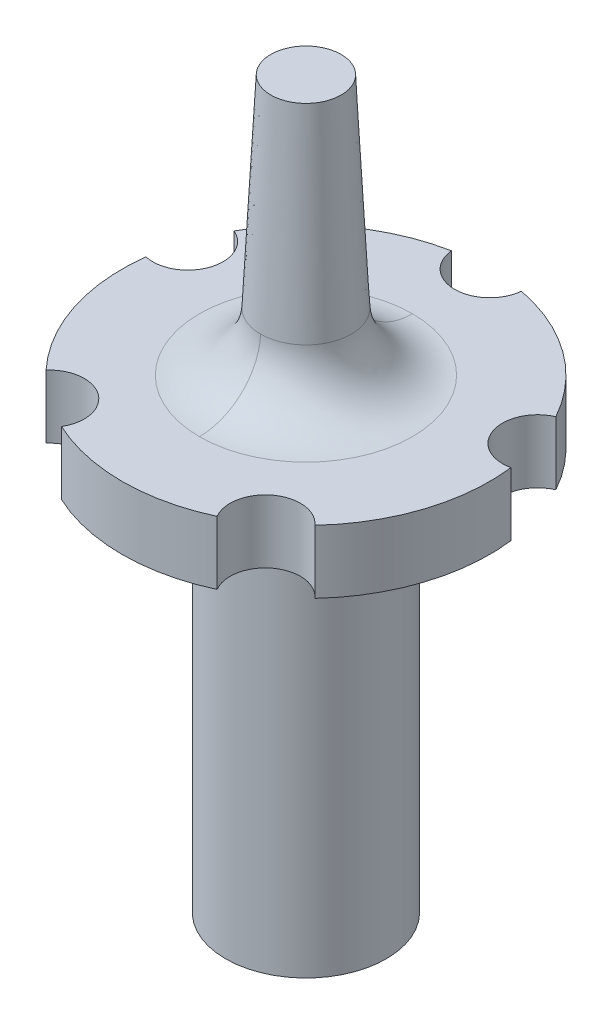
ISO-10303-21;
HEADER;
FILE_DESCRIPTION(('STEP AP214'),'2;1');
FILE_NAME('part.step','',(''),(''),'','','');
FILE_SCHEMA(('AUTOMOTIVE_DESIGN { 1 0 10303 214 1 1 1 1 }'));
ENDSEC;
DATA;
#1=APPLICATION_CONTEXT('core data for automotive mechanical design processes');
#2=APPLICATION_PROTOCOL_DEFINITION('international standard','automotive_design',2000,#1);
#3=PRODUCT_CONTEXT('',#1,'mechanical');
#4=PRODUCT('Part','Part','',(#3));
#5=PRODUCT_RELATED_PRODUCT_CATEGORY('part','',(#4));
#6=PRODUCT_DEFINITION_FORMATION('','',#4);
#7=PRODUCT_DEFINITION_CONTEXT('part definition',#1,'design');
#8=PRODUCT_DEFINITION('design','',#6,#7);
#9=PRODUCT_DEFINITION_SHAPE('','',#8);
#10=(LENGTH_UNIT() NAMED_UNIT(*) SI_UNIT(.MILLI.,.METRE.));
#11=(NAMED_UNIT(*) PLANE_ANGLE_UNIT() SI_UNIT($,.RADIAN.));
#12=(NAMED_UNIT(*) SI_UNIT($,.STERADIAN.) SOLID_ANGLE_UNIT());
#13=UNCERTAINTY_MEASURE_WITH_UNIT(LENGTH_MEASURE(1.E-05),#10,'distance_accuracy_value','');
#14=(GEOMETRIC_REPRESENTATION_CONTEXT(3) GLOBAL_UNCERTAINTY_ASSIGNED_CONTEXT((#13)) GLOBAL_UNIT_ASSIGNED_CONTEXT((#10,
#11,#12)) REPRESENTATION_CONTEXT('',''));
#15=CARTESIAN_POINT('',(0.,0.,0.));
#16=DIRECTION('',(0.,0.,1.));
#17=DIRECTION('',(1.,0.,0.));
#18=AXIS2_PLACEMENT_3D('',#15,#16,#17);
#19=CARTESIAN_POINT('',(0.,8.1788,0.));
#20=DIRECTION('',(0.,1.,0.));
#21=DIRECTION('',(0.,0.,1.));
#22=AXIS2_PLACEMENT_3D('',#19,#20,#21);
#23=PLANE('',#22);
#24=CARTESIAN_POINT('',(0.,8.17879999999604,0.));
#25=DIRECTION('',(0.,-1.,0.));
#26=DIRECTION('',(1.,0.,0.));
#27=AXIS2_PLACEMENT_3D('',#24,#25,#26);
#28=CIRCLE('',#27,0.889000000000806);
#29=CARTESIAN_POINT('',(0.889000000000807,8.17879999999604,0.));
#30=VERTEX_POINT('',#29);
#31=EDGE_CURVE('E20',#30,#30,#28,.T.);
#32=ORIENTED_EDGE('',*,*,#31,.F.);
#33=EDGE_LOOP('',(#32));
#34=FACE_BOUND('',#33,.T.);
#35=ADVANCED_FACE('F17',(#34),#23,.T.);
#36=CARTESIAN_POINT('',(0.,3.07192865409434,0.));
#37=DIRECTION('',(0.,-1.,0.));
#38=DIRECTION('',(1.,0.,0.));
#39=AXIS2_PLACEMENT_3D('',#36,#37,#38);
#40=CONICAL_SURFACE('',#39,1.14532945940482,0.0501509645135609);
#41=CARTESIAN_POINT('',(-1.27000007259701E-08,3.07192865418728,0.));
#42=DIRECTION('',(0.,1.,0.));
#43=DIRECTION('',(7.815365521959E-09,0.,1.));
#44=AXIS2_PLACEMENT_3D('',#41,#42,#43);
#45=CIRCLE('',#44,1.14532946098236);
#46=CARTESIAN_POINT('',(-2.10932666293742E-09,3.07192865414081,1.14532946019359));
#47=VERTEX_POINT('',#46);
#48=CARTESIAN_POINT('',(0.,3.0719286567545,-1.14532946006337));
#49=VERTEX_POINT('',#48);
#50=EDGE_CURVE('E54',#47,#49,#45,.T.);
#51=ORIENTED_EDGE('',*,*,#50,.T.);
#52=CARTESIAN_POINT('',(1.27000007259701E-08,3.07192865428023,0.));
#53=DIRECTION('',(0.,1.,0.));
#54=DIRECTION('',(-7.815365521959E-09,0.,-1.));
#55=AXIS2_PLACEMENT_3D('',#52,#53,#54);
#56=CIRCLE('',#55,1.14532946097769);
#57=EDGE_CURVE('E69',#49,#47,#56,.T.);
#58=ORIENTED_EDGE('',*,*,#57,.T.);
#59=EDGE_LOOP('',(#51,#58));
#60=FACE_BOUND('',#59,.T.);
#61=ORIENTED_EDGE('',*,*,#31,.T.);
#62=EDGE_LOOP('',(#61));
#63=FACE_BOUND('',#62,.T.);
#64=ADVANCED_FACE('F70',(#60,#63),#40,.T.);
#65=CARTESIAN_POINT('',(-1.27000007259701E-08,3.14959999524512,0.));
#66=DIRECTION('',(0.,1.,0.));
#67=DIRECTION('',(7.815365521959E-09,0.,1.));
#68=AXIS2_PLACEMENT_3D('',#65,#66,#67);
#69=TOROIDAL_SURFACE('',#68,2.69278140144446,1.54939999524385);
#70=ORIENTED_EDGE('',*,*,#50,.F.);
#71=CARTESIAN_POINT('',(-1.8263537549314E-08,3.14959999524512,2.69278140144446));
#72=DIRECTION('',(1.,0.,1.14987195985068E-08));
#73=DIRECTION('',(-1.14987195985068E-08,0.,1.));
#74=AXIS2_PLACEMENT_3D('',#71,#72,#73);
#75=CIRCLE('',#74,1.54939999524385);
#76=CARTESIAN_POINT('',(-3.30615578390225E-09,1.60020000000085,2.69278140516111));
#77=VERTEX_POINT('',#76);
#78=EDGE_CURVE('E63',#47,#77,#75,.F.);
#79=ORIENTED_EDGE('',*,*,#78,.T.);
#80=CARTESIAN_POINT('',(-1.27000007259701E-08,1.60020000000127,0.));
#81=DIRECTION('',(0.,1.,0.));
#82=DIRECTION('',(7.815365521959E-09,0.,1.));
#83=AXIS2_PLACEMENT_3D('',#80,#81,#82);
#84=CIRCLE('',#83,2.69278140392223);
#85=CARTESIAN_POINT('',(8.65760356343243E-09,1.60020000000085,-2.69278140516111));
#86=VERTEX_POINT('',#85);
#87=EDGE_CURVE('E73',#86,#77,#84,.F.);
#88=ORIENTED_EDGE('',*,*,#87,.F.);
#89=CARTESIAN_POINT('',(1.71589410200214E-08,3.14959999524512,-2.69278140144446));
#90=DIRECTION('',(-1.,0.,-1.10885130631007E-08));
#91=DIRECTION('',(1.10885130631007E-08,0.,-1.));
#92=AXIS2_PLACEMENT_3D('',#89,#90,#91);
#93=CIRCLE('',#92,1.54939999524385);
#94=EDGE_CURVE('E66',#86,#49,#93,.T.);
#95=ORIENTED_EDGE('',*,*,#94,.T.);
#96=EDGE_LOOP('',(#70,#79,#88,#95));
#97=FACE_BOUND('',#96,.T.);
#98=ADVANCED_FACE('F61',(#97),#69,.F.);
#99=CARTESIAN_POINT('',(1.27000007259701E-08,3.14959999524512,0.));
#100=DIRECTION('',(0.,1.,0.));
#101=DIRECTION('',(-7.815365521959E-09,0.,-1.));
#102=AXIS2_PLACEMENT_3D('',#99,#100,#101);
#103=TOROIDAL_SURFACE('',#102,2.69278140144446,1.54939999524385);
#104=ORIENTED_EDGE('',*,*,#94,.F.);
#105=CARTESIAN_POINT('',(1.27000007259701E-08,1.60020000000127,0.));
#106=DIRECTION('',(0.,1.,0.));
#107=DIRECTION('',(-7.815365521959E-09,0.,-1.));
#108=AXIS2_PLACEMENT_3D('',#105,#106,#107);
#109=CIRCLE('',#108,2.69278140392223);
#110=EDGE_CURVE('E77',#77,#86,#109,.F.);
#111=ORIENTED_EDGE('',*,*,#110,.F.);
#112=ORIENTED_EDGE('',*,*,#78,.F.);
#113=ORIENTED_EDGE('',*,*,#57,.F.);
#114=EDGE_LOOP('',(#104,#111,#112,#113));
#115=FACE_BOUND('',#114,.T.);
#116=ADVANCED_FACE('F75',(#115),#103,.F.);
#117=CARTESIAN_POINT('',(1.39980431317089E-06,1.6002,0.0425068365));
#118=DIRECTION('',(0.,1.,0.));
#119=DIRECTION('',(0.,0.,1.));
#120=AXIS2_PLACEMENT_3D('',#117,#118,#119);
#121=PLANE('',#120);
#122=ORIENTED_EDGE('',*,*,#87,.T.);
#123=ORIENTED_EDGE('',*,*,#110,.T.);
#124=EDGE_LOOP('',(#122,#123));
#125=FACE_BOUND('',#124,.T.);
#126=CARTESIAN_POINT('',(0.,1.6002,0.));
#127=DIRECTION('',(0.,1.,0.));
#128=DIRECTION('',(0.,0.,1.));
#129=AXIS2_PLACEMENT_3D('',#126,#127,#128);
#130=CIRCLE('',#129,4.6482);
#131=CARTESIAN_POINT('',(0.884925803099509,1.6002,-4.56318633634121));
#132=VERTEX_POINT('',#131);
#133=CARTESIAN_POINT('',(4.06639099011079,1.6002,-2.2517165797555));
#134=VERTEX_POINT('',#133);
#135=EDGE_CURVE('E105',#132,#134,#130,.F.);
#136=ORIENTED_EDGE('',*,*,#135,.F.);
#137=CARTESIAN_POINT('',(0.,1.6002,-4.6482));
#138=DIRECTION('',(0.,1.,0.));
#139=DIRECTION('',(0.,0.,1.));
#140=AXIS2_PLACEMENT_3D('',#137,#138,#139);
#141=CIRCLE('',#140,0.889);
#142=CARTESIAN_POINT('',(-0.884925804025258,1.6002,-4.56318633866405));
#143=VERTEX_POINT('',#142);
#144=EDGE_CURVE('E109',#132,#143,#141,.F.);
#145=ORIENTED_EDGE('',*,*,#144,.T.);
#146=CARTESIAN_POINT('',(0.,1.6002,0.));
#147=DIRECTION('',(0.,1.,0.));
#148=DIRECTION('',(0.,0.,1.));
#149=AXIS2_PLACEMENT_3D('',#146,#147,#148);
#150=CIRCLE('',#149,4.6482);
#151=CARTESIAN_POINT('',(-4.06639098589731,1.6002,-2.25171658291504));
#152=VERTEX_POINT('',#151);
#153=EDGE_CURVE('E112',#152,#143,#150,.F.);
#154=ORIENTED_EDGE('',*,*,#153,.F.);
#155=CARTESIAN_POINT('',(-4.4207008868,1.6002,-1.436372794));
#156=DIRECTION('',(0.,1.,0.));
#157=DIRECTION('',(0.,0.,1.));
#158=AXIS2_PLACEMENT_3D('',#155,#156,#157);
#159=CIRCLE('',#158,0.889);
#160=CARTESIAN_POINT('',(-4.613305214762,1.6002,-0.568487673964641));
#161=VERTEX_POINT('',#160);
#162=EDGE_CURVE('E116',#152,#161,#159,.F.);
#163=ORIENTED_EDGE('',*,*,#162,.T.);
#164=CARTESIAN_POINT('',(0.,1.6002,0.));
#165=DIRECTION('',(0.,1.,0.));
#166=DIRECTION('',(0.,0.,1.));
#167=AXIS2_PLACEMENT_3D('',#164,#165,#166);
#168=CIRCLE('',#167,4.6482);
#169=CARTESIAN_POINT('',(-3.39809364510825,1.6002,3.17154896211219));
#170=VERTEX_POINT('',#169);
#171=EDGE_CURVE('E121',#170,#161,#168,.F.);
#172=ORIENTED_EDGE('',*,*,#171,.F.);
#173=CARTESIAN_POINT('',(-2.7321434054,1.6002,3.760472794));
#174=DIRECTION('',(0.,1.,0.));
#175=DIRECTION('',(0.,0.,1.));
#176=AXIS2_PLACEMENT_3D('',#173,#174,#175);
#177=CIRCLE('',#176,0.889);
#178=CARTESIAN_POINT('',(-1.9662536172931,1.6002,4.21184163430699));
#179=VERTEX_POINT('',#178);
#180=EDGE_CURVE('E86',#170,#179,#177,.F.);
#181=ORIENTED_EDGE('',*,*,#180,.T.);
#182=CARTESIAN_POINT('',(0.,1.6002,0.));
#183=DIRECTION('',(0.,1.,0.));
#184=DIRECTION('',(0.,0.,1.));
#185=AXIS2_PLACEMENT_3D('',#182,#183,#184);
#186=CIRCLE('',#185,4.6482);
#187=CARTESIAN_POINT('',(1.96625361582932,1.6002,4.21184163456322));
#188=VERTEX_POINT('',#187);
#189=EDGE_CURVE('E90',#188,#179,#186,.F.);
#190=ORIENTED_EDGE('',*,*,#189,.F.);
#191=CARTESIAN_POINT('',(2.7321434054,1.6002,3.760472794));
#192=DIRECTION('',(0.,1.,0.));
#193=DIRECTION('',(0.,0.,1.));
#194=AXIS2_PLACEMENT_3D('',#191,#192,#193);
#195=CIRCLE('',#194,0.889);
#196=CARTESIAN_POINT('',(3.39809364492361,1.6002,3.17154896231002));
#197=VERTEX_POINT('',#196);
#198=EDGE_CURVE('E93',#188,#197,#195,.F.);
#199=ORIENTED_EDGE('',*,*,#198,.T.);
#200=CARTESIAN_POINT('',(0.,1.6002,0.));
#201=DIRECTION('',(0.,1.,0.));
#202=DIRECTION('',(0.,0.,1.));
#203=AXIS2_PLACEMENT_3D('',#200,#201,#202);
#204=CIRCLE('',#203,4.6482);
#205=CARTESIAN_POINT('',(4.61330521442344,1.6002,-0.568487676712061));
#206=VERTEX_POINT('',#205);
#207=EDGE_CURVE('E97',#206,#197,#204,.F.);
#208=ORIENTED_EDGE('',*,*,#207,.F.);
#209=CARTESIAN_POINT('',(4.4207008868,1.6002,-1.436372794));
#210=DIRECTION('',(0.,1.,0.));
#211=DIRECTION('',(0.,0.,1.));
#212=AXIS2_PLACEMENT_3D('',#209,#210,#211);
#213=CIRCLE('',#212,0.889);
#214=EDGE_CURVE('E100',#206,#134,#213,.F.);
#215=ORIENTED_EDGE('',*,*,#214,.T.);
#216=EDGE_LOOP('',(#136,#145,#154,#163,#172,#181,#190,#199,#208,#215));
#217=FACE_BOUND('',#216,.T.);
#218=ADVANCED_FACE('F185',(#125,#217),#121,.T.);
#219=CARTESIAN_POINT('',(-2.7321434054,0.,3.760472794));
#220=DIRECTION('',(0.,1.,0.));
#221=DIRECTION('',(0.,0.,1.));
#222=AXIS2_PLACEMENT_3D('',#219,#220,#221);
#223=CYLINDRICAL_SURFACE('',#222,0.889);
#224=CARTESIAN_POINT('',(-2.7321434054,0.,3.760472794));
#225=DIRECTION('',(0.,1.,0.));
#226=DIRECTION('',(0.,0.,1.));
#227=AXIS2_PLACEMENT_3D('',#224,#225,#226);
#228=CIRCLE('',#227,0.889);
#229=CARTESIAN_POINT('',(-3.39809364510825,0.,3.17154896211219));
#230=VERTEX_POINT('',#229);
#231=CARTESIAN_POINT('',(-1.9662536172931,0.,4.21184163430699));
#232=VERTEX_POINT('',#231);
#233=EDGE_CURVE('E124',#230,#232,#228,.F.);
#234=ORIENTED_EDGE('',*,*,#233,.T.);
#235=DIRECTION('',(0.,1.,0.));
#236=VECTOR('',#235,1.);
#237=CARTESIAN_POINT('',(-1.96625361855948,0.,4.2118416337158));
#238=LINE('',#237,#236);
#239=EDGE_CURVE('E89',#179,#232,#238,.F.);
#240=ORIENTED_EDGE('',*,*,#239,.F.);
#241=ORIENTED_EDGE('',*,*,#180,.F.);
#242=DIRECTION('',(0.,1.,0.));
#243=VECTOR('',#242,1.);
#244=CARTESIAN_POINT('',(-3.39809364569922,0.,3.17154896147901));
#245=LINE('',#244,#243);
#246=EDGE_CURVE('E125',#230,#170,#245,.T.);
#247=ORIENTED_EDGE('',*,*,#246,.F.);
#248=EDGE_LOOP('',(#234,#240,#241,#247));
#249=FACE_BOUND('',#248,.T.);
#250=ADVANCED_FACE('F194',(#249),#223,.F.);
#251=CARTESIAN_POINT('',(0.,0.,0.));
#252=DIRECTION('',(0.,1.,0.));
#253=DIRECTION('',(0.,0.,1.));
#254=AXIS2_PLACEMENT_3D('',#251,#252,#253);
#255=CYLINDRICAL_SURFACE('',#254,4.6482);
#256=ORIENTED_EDGE('',*,*,#189,.T.);
#257=ORIENTED_EDGE('',*,*,#239,.T.);
#258=CARTESIAN_POINT('',(0.,0.,0.));
#259=DIRECTION('',(0.,1.,0.));
#260=DIRECTION('',(0.,0.,1.));
#261=AXIS2_PLACEMENT_3D('',#258,#259,#260);
#262=CIRCLE('',#261,4.6482);
#263=CARTESIAN_POINT('',(1.96625361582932,0.,4.21184163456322));
#264=VERTEX_POINT('',#263);
#265=EDGE_CURVE('E128',#232,#264,#262,.T.);
#266=ORIENTED_EDGE('',*,*,#265,.T.);
#267=DIRECTION('',(0.,1.,0.));
#268=VECTOR('',#267,1.);
#269=CARTESIAN_POINT('',(1.96625361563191,0.,4.21184163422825));
#270=LINE('',#269,#268);
#271=EDGE_CURVE('E96',#264,#188,#270,.T.);
#272=ORIENTED_EDGE('',*,*,#271,.T.);
#273=EDGE_LOOP('',(#256,#257,#266,#272));
#274=FACE_BOUND('',#273,.T.);
#275=ADVANCED_FACE('F249',(#274),#255,.T.);
#276=CARTESIAN_POINT('',(2.7321434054,0.,3.760472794));
#277=DIRECTION('',(0.,1.,0.));
#278=DIRECTION('',(0.,0.,1.));
#279=AXIS2_PLACEMENT_3D('',#276,#277,#278);
#280=CYLINDRICAL_SURFACE('',#279,0.889);
#281=CARTESIAN_POINT('',(2.7321434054,0.,3.760472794));
#282=DIRECTION('',(0.,1.,0.));
#283=DIRECTION('',(0.,0.,1.));
#284=AXIS2_PLACEMENT_3D('',#281,#282,#283);
#285=CIRCLE('',#284,0.889);
#286=CARTESIAN_POINT('',(3.39809364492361,0.,3.17154896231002));
#287=VERTEX_POINT('',#286);
#288=EDGE_CURVE('E131',#264,#287,#285,.F.);
#289=ORIENTED_EDGE('',*,*,#288,.T.);
#290=DIRECTION('',(0.,1.,0.));
#291=VECTOR('',#290,1.);
#292=CARTESIAN_POINT('',(3.39809364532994,0.,3.17154896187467));
#293=LINE('',#292,#291);
#294=EDGE_CURVE('E211',#197,#287,#293,.F.);
#295=ORIENTED_EDGE('',*,*,#294,.F.);
#296=ORIENTED_EDGE('',*,*,#198,.F.);
#297=ORIENTED_EDGE('',*,*,#271,.F.);
#298=EDGE_LOOP('',(#289,#295,#296,#297));
#299=FACE_BOUND('',#298,.T.);
#300=ADVANCED_FACE('F300',(#299),#280,.F.);
#301=CARTESIAN_POINT('',(0.,0.,0.));
#302=DIRECTION('',(0.,1.,0.));
#303=DIRECTION('',(0.,0.,1.));
#304=AXIS2_PLACEMENT_3D('',#301,#302,#303);
#305=CYLINDRICAL_SURFACE('',#304,4.6482);
#306=DIRECTION('',(0.,1.,0.));
#307=VECTOR('',#306,1.);
#308=CARTESIAN_POINT('',(4.61330521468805,0.,-0.568487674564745));
#309=LINE('',#308,#307);
#310=CARTESIAN_POINT('',(4.61330521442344,0.,-0.568487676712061));
#311=VERTEX_POINT('',#310);
#312=EDGE_CURVE('E101',#311,#206,#309,.T.);
#313=ORIENTED_EDGE('',*,*,#312,.T.);
#314=ORIENTED_EDGE('',*,*,#207,.T.);
#315=ORIENTED_EDGE('',*,*,#294,.T.);
#316=CARTESIAN_POINT('',(0.,0.,0.));
#317=DIRECTION('',(0.,1.,0.));
#318=DIRECTION('',(0.,0.,1.));
#319=AXIS2_PLACEMENT_3D('',#316,#317,#318);
#320=CIRCLE('',#319,4.6482);
#321=EDGE_CURVE('E134',#287,#311,#320,.T.);
#322=ORIENTED_EDGE('',*,*,#321,.T.);
#323=EDGE_LOOP('',(#313,#314,#315,#322));
#324=FACE_BOUND('',#323,.T.);
#325=ADVANCED_FACE('F298',(#324),#305,.T.);
#326=CARTESIAN_POINT('',(4.4207008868,0.,-1.436372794));
#327=DIRECTION('',(0.,1.,0.));
#328=DIRECTION('',(0.,0.,1.));
#329=AXIS2_PLACEMENT_3D('',#326,#327,#328);
#330=CYLINDRICAL_SURFACE('',#329,0.889);
#331=CARTESIAN_POINT('',(4.4207008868,0.,-1.436372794));
#332=DIRECTION('',(0.,1.,0.));
#333=DIRECTION('',(0.,0.,1.));
#334=AXIS2_PLACEMENT_3D('',#331,#332,#333);
#335=CIRCLE('',#334,0.889);
#336=CARTESIAN_POINT('',(4.06639099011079,0.,-2.2517165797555));
#337=VERTEX_POINT('',#336);
#338=EDGE_CURVE('E137',#311,#337,#335,.F.);
#339=ORIENTED_EDGE('',*,*,#338,.T.);
#340=DIRECTION('',(0.,1.,0.));
#341=VECTOR('',#340,1.);
#342=CARTESIAN_POINT('',(4.06639099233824,0.,-2.25171657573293));
#343=LINE('',#342,#341);
#344=EDGE_CURVE('E104',#134,#337,#343,.F.);
#345=ORIENTED_EDGE('',*,*,#344,.F.);
#346=ORIENTED_EDGE('',*,*,#214,.F.);
#347=ORIENTED_EDGE('',*,*,#312,.F.);
#348=EDGE_LOOP('',(#339,#345,#346,#347));
#349=FACE_BOUND('',#348,.T.);
#350=ADVANCED_FACE('F296',(#349),#330,.F.);
#351=CARTESIAN_POINT('',(0.,0.,0.));
#352=DIRECTION('',(0.,1.,0.));
#353=DIRECTION('',(0.,0.,1.));
#354=AXIS2_PLACEMENT_3D('',#351,#352,#353);
#355=CYLINDRICAL_SURFACE('',#354,4.6482);
#356=DIRECTION('',(0.,1.,0.));
#357=VECTOR('',#356,1.);
#358=CARTESIAN_POINT('',(0.884925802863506,0.,-4.56318633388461));
#359=LINE('',#358,#357);
#360=CARTESIAN_POINT('',(0.884925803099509,0.,-4.56318633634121));
#361=VERTEX_POINT('',#360);
#362=EDGE_CURVE('E108',#361,#132,#359,.T.);
#363=ORIENTED_EDGE('',*,*,#362,.T.);
#364=ORIENTED_EDGE('',*,*,#135,.T.);
#365=ORIENTED_EDGE('',*,*,#344,.T.);
#366=CARTESIAN_POINT('',(0.,0.,0.));
#367=DIRECTION('',(0.,1.,0.));
#368=DIRECTION('',(0.,0.,1.));
#369=AXIS2_PLACEMENT_3D('',#366,#367,#368);
#370=CIRCLE('',#369,4.6482);
#371=EDGE_CURVE('E140',#337,#361,#370,.T.);
#372=ORIENTED_EDGE('',*,*,#371,.T.);
#373=EDGE_LOOP('',(#363,#364,#365,#372));
#374=FACE_BOUND('',#373,.T.);
#375=ADVANCED_FACE('F294',(#374),#355,.T.);
#376=CARTESIAN_POINT('',(0.,0.,-4.6482));
#377=DIRECTION('',(0.,1.,0.));
#378=DIRECTION('',(0.,0.,1.));
#379=AXIS2_PLACEMENT_3D('',#376,#377,#378);
#380=CYLINDRICAL_SURFACE('',#379,0.889);
#381=CARTESIAN_POINT('',(0.,0.,-4.6482));
#382=DIRECTION('',(0.,1.,0.));
#383=DIRECTION('',(0.,0.,1.));
#384=AXIS2_PLACEMENT_3D('',#381,#382,#383);
#385=CIRCLE('',#384,0.889);
#386=CARTESIAN_POINT('',(-0.884925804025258,0.,-4.56318633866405));
#387=VERTEX_POINT('',#386);
#388=EDGE_CURVE('E143',#361,#387,#385,.F.);
#389=ORIENTED_EDGE('',*,*,#388,.T.);
#390=DIRECTION('',(0.,1.,0.));
#391=VECTOR('',#390,1.);
#392=CARTESIAN_POINT('',(-0.884925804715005,0.,-4.56318633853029));
#393=LINE('',#392,#391);
#394=EDGE_CURVE('E115',#143,#387,#393,.F.);
#395=ORIENTED_EDGE('',*,*,#394,.F.);
#396=ORIENTED_EDGE('',*,*,#144,.F.);
#397=ORIENTED_EDGE('',*,*,#362,.F.);
#398=EDGE_LOOP('',(#389,#395,#396,#397));
#399=FACE_BOUND('',#398,.T.);
#400=ADVANCED_FACE('F289',(#399),#380,.F.);
#401=CARTESIAN_POINT('',(0.,0.,0.));
#402=DIRECTION('',(0.,1.,0.));
#403=DIRECTION('',(0.,0.,1.));
#404=AXIS2_PLACEMENT_3D('',#401,#402,#403);
#405=CYLINDRICAL_SURFACE('',#404,4.6482);
#406=ORIENTED_EDGE('',*,*,#394,.T.);
#407=CARTESIAN_POINT('',(0.,0.,0.));
#408=DIRECTION('',(0.,1.,0.));
#409=DIRECTION('',(0.,0.,1.));
#410=AXIS2_PLACEMENT_3D('',#407,#408,#409);
#411=CIRCLE('',#410,4.6482);
#412=CARTESIAN_POINT('',(-4.06639098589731,0.,-2.25171658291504));
#413=VERTEX_POINT('',#412);
#414=EDGE_CURVE('E146',#387,#413,#411,.T.);
#415=ORIENTED_EDGE('',*,*,#414,.T.);
#416=DIRECTION('',(0.,1.,0.));
#417=VECTOR('',#416,1.);
#418=CARTESIAN_POINT('',(-4.06639098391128,0.,-2.251716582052));
#419=LINE('',#418,#417);
#420=EDGE_CURVE('E120',#413,#152,#419,.T.);
#421=ORIENTED_EDGE('',*,*,#420,.T.);
#422=ORIENTED_EDGE('',*,*,#153,.T.);
#423=EDGE_LOOP('',(#406,#415,#421,#422));
#424=FACE_BOUND('',#423,.T.);
#425=ADVANCED_FACE('F292',(#424),#405,.T.);
#426=CARTESIAN_POINT('',(-4.4207008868,0.,-1.436372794));
#427=DIRECTION('',(0.,1.,0.));
#428=DIRECTION('',(0.,0.,1.));
#429=AXIS2_PLACEMENT_3D('',#426,#427,#428);
#430=CYLINDRICAL_SURFACE('',#429,0.889);
#431=CARTESIAN_POINT('',(-4.4207008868,0.,-1.436372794));
#432=DIRECTION('',(0.,1.,0.));
#433=DIRECTION('',(0.,0.,1.));
#434=AXIS2_PLACEMENT_3D('',#431,#432,#433);
#435=CIRCLE('',#434,0.889);
#436=CARTESIAN_POINT('',(-4.613305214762,0.,-0.568487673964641));
#437=VERTEX_POINT('',#436);
#438=EDGE_CURVE('E35',#413,#437,#435,.F.);
#439=ORIENTED_EDGE('',*,*,#438,.T.);
#440=DIRECTION('',(0.,1.,0.));
#441=VECTOR('',#440,1.);
#442=CARTESIAN_POINT('',(-4.61330521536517,0.,-0.568487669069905));
#443=LINE('',#442,#441);
#444=EDGE_CURVE('E119',#161,#437,#443,.F.);
#445=ORIENTED_EDGE('',*,*,#444,.F.);
#446=ORIENTED_EDGE('',*,*,#162,.F.);
#447=ORIENTED_EDGE('',*,*,#420,.F.);
#448=EDGE_LOOP('',(#439,#445,#446,#447));
#449=FACE_BOUND('',#448,.T.);
#450=ADVANCED_FACE('F326',(#449),#430,.F.);
#451=CARTESIAN_POINT('',(0.,0.,0.));
#452=DIRECTION('',(0.,1.,0.));
#453=DIRECTION('',(0.,0.,1.));
#454=AXIS2_PLACEMENT_3D('',#451,#452,#453);
#455=CYLINDRICAL_SURFACE('',#454,4.6482);
#456=ORIENTED_EDGE('',*,*,#246,.T.);
#457=ORIENTED_EDGE('',*,*,#171,.T.);
#458=ORIENTED_EDGE('',*,*,#444,.T.);
#459=CARTESIAN_POINT('',(0.,0.,0.));
#460=DIRECTION('',(0.,1.,0.));
#461=DIRECTION('',(0.,0.,1.));
#462=AXIS2_PLACEMENT_3D('',#459,#460,#461);
#463=CIRCLE('',#462,4.6482);
#464=EDGE_CURVE('E149',#437,#230,#463,.T.);
#465=ORIENTED_EDGE('',*,*,#464,.T.);
#466=EDGE_LOOP('',(#456,#457,#458,#465));
#467=FACE_BOUND('',#466,.T.);
#468=ADVANCED_FACE('F228',(#467),#455,.T.);
#469=CARTESIAN_POINT('',(0.,-10.16,0.));
#470=DIRECTION('',(0.,1.,0.));
#471=DIRECTION('',(0.,0.,1.));
#472=AXIS2_PLACEMENT_3D('',#469,#470,#471);
#473=PLANE('',#472);
#474=CARTESIAN_POINT('',(0.,-10.16,0.));
#475=DIRECTION('',(0.,1.,0.));
#476=DIRECTION('',(0.,0.,1.));
#477=AXIS2_PLACEMENT_3D('',#474,#475,#476);
#478=CIRCLE('',#477,2.032);
#479=CARTESIAN_POINT('',(0.,-10.16,2.032));
#480=VERTEX_POINT('',#479);
#481=EDGE_CURVE('E26',#480,#480,#478,.T.);
#482=ORIENTED_EDGE('',*,*,#481,.F.);
#483=EDGE_LOOP('',(#482));
#484=FACE_BOUND('',#483,.T.);
#485=ADVANCED_FACE('F316',(#484),#473,.F.);
#486=CARTESIAN_POINT('',(-1.39980431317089E-06,0.,0.0425068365));
#487=DIRECTION('',(0.,1.,0.));
#488=DIRECTION('',(0.,0.,1.));
#489=AXIS2_PLACEMENT_3D('',#486,#487,#488);
#490=PLANE('',#489);
#491=CARTESIAN_POINT('',(0.,0.,0.));
#492=DIRECTION('',(0.,1.,0.));
#493=DIRECTION('',(0.,0.,1.));
#494=AXIS2_PLACEMENT_3D('',#491,#492,#493);
#495=CIRCLE('',#494,2.032);
#496=CARTESIAN_POINT('',(0.,0.,2.032));
#497=VERTEX_POINT('',#496);
#498=EDGE_CURVE('E11',#497,#497,#495,.F.);
#499=ORIENTED_EDGE('',*,*,#498,.F.);
#500=EDGE_LOOP('',(#499));
#501=FACE_BOUND('',#500,.T.);
#502=ORIENTED_EDGE('',*,*,#464,.F.);
#503=ORIENTED_EDGE('',*,*,#438,.F.);
#504=ORIENTED_EDGE('',*,*,#414,.F.);
#505=ORIENTED_EDGE('',*,*,#388,.F.);
#506=ORIENTED_EDGE('',*,*,#371,.F.);
#507=ORIENTED_EDGE('',*,*,#338,.F.);
#508=ORIENTED_EDGE('',*,*,#321,.F.);
#509=ORIENTED_EDGE('',*,*,#288,.F.);
#510=ORIENTED_EDGE('',*,*,#265,.F.);
#511=ORIENTED_EDGE('',*,*,#233,.F.);
#512=EDGE_LOOP('',(#502,#503,#504,#505,#506,#507,#508,#509,#510,#511));
#513=FACE_BOUND('',#512,.T.);
#514=ADVANCED_FACE('F234',(#501,#513),#490,.F.);
#515=CARTESIAN_POINT('',(0.,-10.16,0.));
#516=DIRECTION('',(0.,1.,0.));
#517=DIRECTION('',(0.,0.,1.));
#518=AXIS2_PLACEMENT_3D('',#515,#516,#517);
#519=CYLINDRICAL_SURFACE('',#518,2.032);
#520=ORIENTED_EDGE('',*,*,#498,.T.);
#521=EDGE_LOOP('',(#520));
#522=FACE_BOUND('',#521,.T.);
#523=ORIENTED_EDGE('',*,*,#481,.T.);
#524=EDGE_LOOP('',(#523));
#525=FACE_BOUND('',#524,.T.);
#526=ADVANCED_FACE('F309',(#522,#525),#519,.T.);
#527=CLOSED_SHELL('',(#35,#64,#98,#116,#218,#250,#275,#300,#325,#350,#375,#400,#425,#450,#468,
#485,#514,#526));
#528=MANIFOLD_SOLID_BREP('B1',#527);
#529=ADVANCED_BREP_SHAPE_REPRESENTATION('',(#18,#528),#14);
#530=SHAPE_DEFINITION_REPRESENTATION(#9,#529);
ENDSEC;
END-ISO-10303-21;
